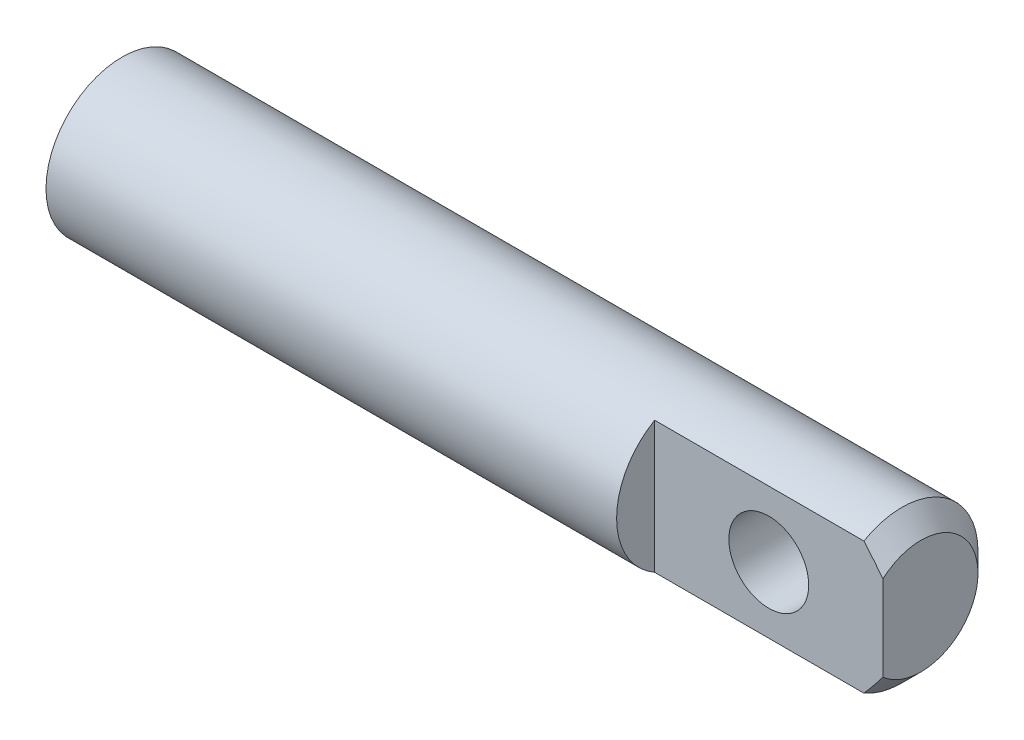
ISO-10303-21;
HEADER;
FILE_DESCRIPTION(('STEP AP214'),'2;1');
FILE_NAME('part.step','',(''),(''),'','','');
FILE_SCHEMA(('AUTOMOTIVE_DESIGN { 1 0 10303 214 1 1 1 1 }'));
ENDSEC;
DATA;
#1=APPLICATION_CONTEXT('core data for automotive mechanical design processes');
#2=APPLICATION_PROTOCOL_DEFINITION('international standard','automotive_design',2000,#1);
#3=PRODUCT_CONTEXT('',#1,'mechanical');
#4=PRODUCT('Part','Part','',(#3));
#5=PRODUCT_RELATED_PRODUCT_CATEGORY('part','',(#4));
#6=PRODUCT_DEFINITION_FORMATION('','',#4);
#7=PRODUCT_DEFINITION_CONTEXT('part definition',#1,'design');
#8=PRODUCT_DEFINITION('design','',#6,#7);
#9=PRODUCT_DEFINITION_SHAPE('','',#8);
#10=(LENGTH_UNIT() NAMED_UNIT(*) SI_UNIT(.MILLI.,.METRE.));
#11=(NAMED_UNIT(*) PLANE_ANGLE_UNIT() SI_UNIT($,.RADIAN.));
#12=(NAMED_UNIT(*) SI_UNIT($,.STERADIAN.) SOLID_ANGLE_UNIT());
#13=UNCERTAINTY_MEASURE_WITH_UNIT(LENGTH_MEASURE(1.E-05),#10,'distance_accuracy_value','');
#14=(GEOMETRIC_REPRESENTATION_CONTEXT(3) GLOBAL_UNCERTAINTY_ASSIGNED_CONTEXT((#13)) GLOBAL_UNIT_ASSIGNED_CONTEXT((#10,
#11,#12)) REPRESENTATION_CONTEXT('',''));
#15=CARTESIAN_POINT('',(0.,0.,0.));
#16=DIRECTION('',(0.,0.,1.));
#17=DIRECTION('',(1.,0.,0.));
#18=AXIS2_PLACEMENT_3D('',#15,#16,#17);
#19=CARTESIAN_POINT('',(0.,0.,0.));
#20=DIRECTION('',(1.,0.,0.));
#21=DIRECTION('',(0.,0.,-1.));
#22=AXIS2_PLACEMENT_3D('',#19,#20,#21);
#23=PLANE('',#22);
#24=CARTESIAN_POINT('',(0.,0.,0.));
#25=DIRECTION('',(-1.,0.,0.));
#26=DIRECTION('',(0.,0.,1.));
#27=AXIS2_PLACEMENT_3D('',#24,#25,#26);
#28=CIRCLE('',#27,2.);
#29=CARTESIAN_POINT('',(0.,0.,2.));
#30=VERTEX_POINT('',#29);
#31=EDGE_CURVE('E39',#30,#30,#28,.T.);
#32=ORIENTED_EDGE('',*,*,#31,.T.);
#33=EDGE_LOOP('',(#32));
#34=FACE_BOUND('',#33,.T.);
#35=ADVANCED_FACE('F32',(#34),#23,.F.);
#36=CARTESIAN_POINT('',(0.,0.,0.));
#37=DIRECTION('',(-1.,0.,0.));
#38=DIRECTION('',(0.,0.,1.));
#39=AXIS2_PLACEMENT_3D('',#36,#37,#38);
#40=CYLINDRICAL_SURFACE('',#39,2.);
#41=CARTESIAN_POINT('',(19.05,0.,-2.));
#42=CARTESIAN_POINT('',(19.0499964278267,0.054864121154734,-1.99999683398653));
#43=CARTESIAN_POINT('',(19.0456747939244,0.109783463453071,-1.99771881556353));
#44=CARTESIAN_POINT('',(19.0285895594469,0.217977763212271,-1.98883014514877));
#45=CARTESIAN_POINT('',(19.0158121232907,0.271249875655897,-1.98221239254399));
#46=CARTESIAN_POINT('',(18.9824634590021,0.374423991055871,-1.96533181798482));
#47=CARTESIAN_POINT('',(18.9619234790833,0.424338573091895,-1.95508362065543));
#48=CARTESIAN_POINT('',(18.9138063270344,0.519927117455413,-1.93186406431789));
#49=CARTESIAN_POINT('',(18.886229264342,0.565601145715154,-1.9188927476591));
#50=CARTESIAN_POINT('',(18.8228024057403,0.65473592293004,-1.89040981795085));
#51=CARTESIAN_POINT('',(18.7865327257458,0.697862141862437,-1.87478813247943));
#52=CARTESIAN_POINT('',(18.7076628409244,0.777732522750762,-1.84309034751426));
#53=CARTESIAN_POINT('',(18.6650573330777,0.814471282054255,-1.8270138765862));
#54=CARTESIAN_POINT('',(18.5702620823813,0.883766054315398,-1.79458801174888));
#55=CARTESIAN_POINT('',(18.5175595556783,0.915672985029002,-1.77833825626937));
#56=CARTESIAN_POINT('',(18.4066105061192,0.970039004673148,-1.74927996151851));
#57=CARTESIAN_POINT('',(18.3483682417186,0.992505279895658,-1.73646880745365));
#58=CARTESIAN_POINT('',(18.2316345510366,1.02581389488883,-1.71699156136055));
#59=CARTESIAN_POINT('',(18.17338254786,1.03729066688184,-1.70999366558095));
#60=CARTESIAN_POINT('',(18.0553959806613,1.05021032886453,-1.70209360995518));
#61=CARTESIAN_POINT('',(17.9956632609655,1.05166512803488,-1.70118421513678));
#62=CARTESIAN_POINT('',(17.8851179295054,1.04496287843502,-1.70530281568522));
#63=CARTESIAN_POINT('',(17.8341911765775,1.03807876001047,-1.70954469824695));
#64=CARTESIAN_POINT('',(17.7343599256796,1.01712241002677,-1.72209458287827));
#65=CARTESIAN_POINT('',(17.6854562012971,1.00304745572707,-1.73040412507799));
#66=CARTESIAN_POINT('',(17.5896697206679,0.967881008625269,-1.75032008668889));
#67=CARTESIAN_POINT('',(17.5428584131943,0.946636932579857,-1.76199731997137));
#68=CARTESIAN_POINT('',(17.4532306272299,0.897858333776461,-1.78734588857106));
#69=CARTESIAN_POINT('',(17.4104159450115,0.870321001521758,-1.80101811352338));
#70=CARTESIAN_POINT('',(17.3236097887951,0.805196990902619,-1.8311522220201));
#71=CARTESIAN_POINT('',(17.2803113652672,0.766739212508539,-1.84773486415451));
#72=CARTESIAN_POINT('',(17.2004725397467,0.683082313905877,-1.88026963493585));
#73=CARTESIAN_POINT('',(17.1639360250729,0.637879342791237,-1.89622139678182));
#74=CARTESIAN_POINT('',(17.0967089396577,0.538834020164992,-1.9267817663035));
#75=CARTESIAN_POINT('',(17.0664607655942,0.48464945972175,-1.94126499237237));
#76=CARTESIAN_POINT('',(17.0157686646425,0.371011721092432,-1.96614386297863));
#77=CARTESIAN_POINT('',(16.9953162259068,0.311563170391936,-1.97654305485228));
#78=CARTESIAN_POINT('',(16.9666136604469,0.194698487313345,-1.9912936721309));
#79=CARTESIAN_POINT('',(16.9574465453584,0.13756541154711,-1.99609753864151));
#80=CARTESIAN_POINT('',(16.9486534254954,0.0223804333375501,-2.00070334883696));
#81=CARTESIAN_POINT('',(16.949022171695,-0.0356709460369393,-2.00050804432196));
#82=CARTESIAN_POINT('',(16.9588136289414,-0.145639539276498,-1.9953836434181));
#83=CARTESIAN_POINT('',(16.9674431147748,-0.197649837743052,-1.99086929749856));
#84=CARTESIAN_POINT('',(16.9922193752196,-0.29936409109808,-1.97813273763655));
#85=CARTESIAN_POINT('',(17.0083669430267,-0.34906780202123,-1.96991013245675));
#86=CARTESIAN_POINT('',(17.0480721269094,-0.446276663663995,-1.95022110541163));
#87=CARTESIAN_POINT('',(17.0718115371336,-0.493691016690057,-1.93867588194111));
#88=CARTESIAN_POINT('',(17.1258095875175,-0.58400578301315,-1.91341051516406));
#89=CARTESIAN_POINT('',(17.1560708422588,-0.62690437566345,-1.89968950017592));
#90=CARTESIAN_POINT('',(17.2259172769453,-0.711777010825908,-1.86965424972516));
#91=CARTESIAN_POINT('',(17.2661490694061,-0.753176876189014,-1.85321912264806));
#92=CARTESIAN_POINT('',(17.3529256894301,-0.828924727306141,-1.82060103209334));
#93=CARTESIAN_POINT('',(17.3994759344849,-0.863266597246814,-1.80441829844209));
#94=CARTESIAN_POINT('',(17.5011677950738,-0.925987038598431,-1.77309145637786));
#95=CARTESIAN_POINT('',(17.5566641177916,-0.953860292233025,-1.75807501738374));
#96=CARTESIAN_POINT('',(17.6725806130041,-0.99958188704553,-1.73249279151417));
#97=CARTESIAN_POINT('',(17.7329937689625,-1.01744423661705,-1.72192079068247));
#98=CARTESIAN_POINT('',(17.8507452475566,-1.04089614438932,-1.70783667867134));
#99=CARTESIAN_POINT('',(17.9078055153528,-1.04751606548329,-1.70373469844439));
#100=CARTESIAN_POINT('',(18.0223465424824,-1.05132201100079,-1.70139066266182));
#101=CARTESIAN_POINT('',(18.0798270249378,-1.0485137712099,-1.70314504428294));
#102=CARTESIAN_POINT('',(18.1865848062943,-1.03452866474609,-1.71166640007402));
#103=CARTESIAN_POINT('',(18.2360471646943,-1.02434795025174,-1.71783575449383));
#104=CARTESIAN_POINT('',(18.3324804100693,-0.9972297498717,-1.7337180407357));
#105=CARTESIAN_POINT('',(18.3794504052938,-0.980289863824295,-1.74343223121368));
#106=CARTESIAN_POINT('',(18.4729982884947,-0.938913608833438,-1.76607769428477));
#107=CARTESIAN_POINT('',(18.5193487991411,-0.914058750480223,-1.77917806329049));
#108=CARTESIAN_POINT('',(18.6075312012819,-0.857985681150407,-1.80688642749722));
#109=CARTESIAN_POINT('',(18.6493606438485,-0.826764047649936,-1.8214952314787));
#110=CARTESIAN_POINT('',(18.7333616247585,-0.753783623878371,-1.85299725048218));
#111=CARTESIAN_POINT('',(18.7747759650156,-0.711163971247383,-1.86992628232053));
#112=CARTESIAN_POINT('',(18.850079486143,-0.619191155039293,-1.90236151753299));
#113=CARTESIAN_POINT('',(18.8839640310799,-0.569833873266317,-1.91786684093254));
#114=CARTESIAN_POINT('',(18.9437138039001,-0.464378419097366,-1.94612151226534));
#115=CARTESIAN_POINT('',(18.969410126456,-0.408167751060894,-1.95881135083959));
#116=CARTESIAN_POINT('',(19.0106371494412,-0.291412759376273,-1.97953693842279));
#117=CARTESIAN_POINT('',(19.0261954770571,-0.230880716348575,-1.98758532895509));
#118=CARTESIAN_POINT('',(19.0408249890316,-0.141380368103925,-1.99519548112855));
#119=CARTESIAN_POINT('',(19.0442595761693,-0.113250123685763,-1.9969913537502));
#120=CARTESIAN_POINT('',(19.0488480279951,-0.0567515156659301,-1.99939444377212));
#121=CARTESIAN_POINT('',(19.0500018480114,-0.0283831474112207,-2.00000163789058));
#122=CARTESIAN_POINT('',(19.05,0.,-2.));
#123=B_SPLINE_CURVE_WITH_KNOTS('',3,(#41,#42,#43,#44,#45,#46,#47,#48,#49,#50,#51,#52,#53,#54,
#55,#56,#57,#58,#59,#60,#61,#62,#63,#64,#65,#66,#67,#68,#69,#70,#71,#72,#73,#74,#75,#76,#77,#78,
#79,#80,#81,#82,#83,#84,#85,#86,#87,#88,#89,#90,#91,#92,#93,#94,#95,#96,#97,#98,#99,#100,#101,
#102,#103,#104,#105,#106,#107,#108,#109,#110,#111,#112,#113,#114,#115,#116,#117,#118,#119,#120,
#121,#122),.UNSPECIFIED.,.T.,.F.,(4,2,2,2,2,2,2,2,2,2,2,2,2,2,2,2,2,2,2,2,2,2,2,2,2,2,2,2,2,2,2,
2,2,2,2,2,2,2,2,2,4),(0.,0.164477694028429,0.329225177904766,0.493316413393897,
0.657405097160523,0.832113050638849,1.00696806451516,1.19715271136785,1.38719232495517,
1.56544714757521,1.7434901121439,1.89746165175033,2.05149153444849,2.20903143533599,
2.36664180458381,2.54658744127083,2.72663620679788,2.91677576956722,3.10674981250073,
3.27997148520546,3.453097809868,3.61111013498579,3.76913913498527,3.93127805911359,
4.0934821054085,4.27278509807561,4.45224280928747,4.64288973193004,4.83326920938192,
5.0050093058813,5.17664494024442,5.32860681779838,5.48062270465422,5.64259984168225,
5.8046642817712,5.98920626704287,6.17386155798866,6.36211058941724,6.54984445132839,
6.63493290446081,6.72002302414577),.UNSPECIFIED.);
#124=CARTESIAN_POINT('',(19.05,0.,-2.));
#125=VERTEX_POINT('',#124);
#126=EDGE_CURVE('E70',#125,#125,#123,.T.);
#127=ORIENTED_EDGE('',*,*,#126,.T.);
#128=EDGE_LOOP('',(#127));
#129=FACE_BOUND('',#128,.T.);
#130=CARTESIAN_POINT('',(20.5,0.,0.));
#131=DIRECTION('',(-1.,0.,0.));
#132=DIRECTION('',(0.,0.,1.));
#133=AXIS2_PLACEMENT_3D('',#130,#131,#132);
#134=CIRCLE('',#133,2.);
#135=CARTESIAN_POINT('',(20.5,1.73205080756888,1.));
#136=VERTEX_POINT('',#135);
#137=CARTESIAN_POINT('',(20.5,-1.73205080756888,1.));
#138=VERTEX_POINT('',#137);
#139=EDGE_CURVE('E80',#136,#138,#134,.T.);
#140=ORIENTED_EDGE('',*,*,#139,.T.);
#141=DIRECTION('',(1.,0.,0.));
#142=VECTOR('',#141,1.);
#143=CARTESIAN_POINT('',(15.,-1.73205080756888,1.));
#144=LINE('',#143,#142);
#145=CARTESIAN_POINT('',(15.,-1.73205080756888,1.));
#146=VERTEX_POINT('',#145);
#147=EDGE_CURVE('E73',#146,#138,#144,.T.);
#148=ORIENTED_EDGE('',*,*,#147,.F.);
#149=CARTESIAN_POINT('',(15.,0.,0.));
#150=DIRECTION('',(1.,0.,0.));
#151=DIRECTION('',(0.,0.,-1.));
#152=AXIS2_PLACEMENT_3D('',#149,#150,#151);
#153=CIRCLE('',#152,2.);
#154=CARTESIAN_POINT('',(15.,1.73205080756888,1.));
#155=VERTEX_POINT('',#154);
#156=EDGE_CURVE('E64',#155,#146,#153,.T.);
#157=ORIENTED_EDGE('',*,*,#156,.F.);
#158=DIRECTION('',(1.,0.,0.));
#159=VECTOR('',#158,1.);
#160=CARTESIAN_POINT('',(15.,1.73205080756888,1.));
#161=LINE('',#160,#159);
#162=EDGE_CURVE('E74',#155,#136,#161,.T.);
#163=ORIENTED_EDGE('',*,*,#162,.T.);
#164=EDGE_LOOP('',(#140,#148,#157,#163));
#165=FACE_BOUND('',#164,.T.);
#166=ORIENTED_EDGE('',*,*,#31,.F.);
#167=EDGE_LOOP('',(#166));
#168=FACE_BOUND('',#167,.T.);
#169=ADVANCED_FACE('F77',(#129,#165,#168),#40,.T.);
#170=CARTESIAN_POINT('',(21.,0.,0.));
#171=DIRECTION('',(-1.,0.,0.));
#172=DIRECTION('',(0.,0.,1.));
#173=AXIS2_PLACEMENT_3D('',#170,#171,#172);
#174=CONICAL_SURFACE('',#173,1.5,0.785398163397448);
#175=ORIENTED_EDGE('',*,*,#139,.F.);
#176=CARTESIAN_POINT('',(18.5394260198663,3.83225080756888,1.));
#177=CARTESIAN_POINT('',(18.6241259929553,3.7447112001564,1.));
#178=CARTESIAN_POINT('',(18.7087341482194,3.65708252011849,1.));
#179=CARTESIAN_POINT('',(18.877715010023,3.4815963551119,1.));
#180=CARTESIAN_POINT('',(18.962087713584,3.39373886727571,1.));
#181=CARTESIAN_POINT('',(19.214860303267,3.12965797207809,1.));
#182=CARTESIAN_POINT('',(19.3828254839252,2.95301808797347,1.));
#183=CARTESIAN_POINT('',(19.7135109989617,2.60155131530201,1.));
#184=CARTESIAN_POINT('',(19.8762687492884,2.42675985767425,1.));
#185=CARTESIAN_POINT('',(20.1179042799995,2.16232006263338,1.));
#186=CARTESIAN_POINT('',(20.1980237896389,2.07380805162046,1.));
#187=CARTESIAN_POINT('',(20.3570727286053,1.89572176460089,1.));
#188=CARTESIAN_POINT('',(20.4360021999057,1.80614752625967,1.));
#189=CARTESIAN_POINT('',(20.5611684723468,1.66126899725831,1.));
#190=CARTESIAN_POINT('',(20.6079663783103,1.60645005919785,1.));
#191=CARTESIAN_POINT('',(20.7007217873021,1.49609455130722,1.));
#192=CARTESIAN_POINT('',(20.746679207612,1.44055791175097,1.));
#193=CARTESIAN_POINT('',(20.8379484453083,1.32797390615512,1.));
#194=CARTESIAN_POINT('',(20.8832482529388,1.27091676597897,1.));
#195=CARTESIAN_POINT('',(20.9722545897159,1.15557501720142,1.));
#196=CARTESIAN_POINT('',(21.0159612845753,1.09729053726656,1.));
#197=CARTESIAN_POINT('',(21.1017589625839,0.978170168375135,1.));
#198=CARTESIAN_POINT('',(21.1438149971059,0.917308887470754,1.));
#199=CARTESIAN_POINT('',(21.2244909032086,0.793192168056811,1.));
#200=CARTESIAN_POINT('',(21.2631060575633,0.72993360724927,1.));
#201=CARTESIAN_POINT('',(21.3344399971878,0.60115056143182,1.));
#202=CARTESIAN_POINT('',(21.3672265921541,0.535664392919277,1.));
#203=CARTESIAN_POINT('',(21.4242601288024,0.401101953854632,1.));
#204=CARTESIAN_POINT('',(21.4485358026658,0.332038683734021,1.));
#205=CARTESIAN_POINT('',(21.4747332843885,0.228445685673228,1.));
#206=CARTESIAN_POINT('',(21.4816684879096,0.195182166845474,1.));
#207=CARTESIAN_POINT('',(21.492365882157,0.128139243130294,1.));
#208=CARTESIAN_POINT('',(21.4961283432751,0.0943598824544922,1.));
#209=CARTESIAN_POINT('',(21.5002117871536,0.0266892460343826,1.));
#210=CARTESIAN_POINT('',(21.5005429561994,-0.00720139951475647,1.));
#211=CARTESIAN_POINT('',(21.4977752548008,-0.074835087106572,1.));
#212=CARTESIAN_POINT('',(21.494676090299,-0.108578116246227,1.));
#213=CARTESIAN_POINT('',(21.4805994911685,-0.208512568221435,1.));
#214=CARTESIAN_POINT('',(21.4648761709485,-0.274066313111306,1.));
#215=CARTESIAN_POINT('',(21.4341501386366,-0.370108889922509,1.));
#216=CARTESIAN_POINT('',(21.4226684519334,-0.401841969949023,1.));
#217=CARTESIAN_POINT('',(21.3977444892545,-0.464529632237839,1.));
#218=CARTESIAN_POINT('',(21.3843026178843,-0.495484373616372,1.));
#219=CARTESIAN_POINT('',(21.3412275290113,-0.588029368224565,1.));
#220=CARTESIAN_POINT('',(21.3091323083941,-0.648465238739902,1.));
#221=CARTESIAN_POINT('',(21.2407049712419,-0.766913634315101,1.));
#222=CARTESIAN_POINT('',(21.2043676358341,-0.824923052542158,1.));
#223=CARTESIAN_POINT('',(21.1287190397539,-0.93928404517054,1.));
#224=CARTESIAN_POINT('',(21.0893965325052,-0.995628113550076,1.));
#225=CARTESIAN_POINT('',(21.0088070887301,-1.10685190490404,1.));
#226=CARTESIAN_POINT('',(20.9675411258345,-1.16173233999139,1.));
#227=CARTESIAN_POINT('',(20.883049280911,-1.27112215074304,1.));
#228=CARTESIAN_POINT('',(20.8398046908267,-1.32561700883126,1.));
#229=CARTESIAN_POINT('',(20.7522506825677,-1.43374642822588,1.));
#230=CARTESIAN_POINT('',(20.7079411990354,-1.48738093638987,1.));
#231=CARTESIAN_POINT('',(20.5740410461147,-1.64702819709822,1.));
#232=CARTESIAN_POINT('',(20.4832698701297,-1.75204921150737,1.));
#233=CARTESIAN_POINT('',(20.3154377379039,-1.9426687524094,1.));
#234=CARTESIAN_POINT('',(20.2386729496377,-2.02853055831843,1.));
#235=CARTESIAN_POINT('',(20.0842043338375,-2.19940947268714,1.));
#236=CARTESIAN_POINT('',(20.0065004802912,-2.28442655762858,1.));
#237=CARTESIAN_POINT('',(19.7722404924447,-2.53871324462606,1.));
#238=CARTESIAN_POINT('',(19.61468051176,-2.70705628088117,1.));
#239=CARTESIAN_POINT('',(19.304543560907,-3.03540360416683,1.));
#240=CARTESIAN_POINT('',(19.1520280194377,-3.19546619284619,1.));
#241=CARTESIAN_POINT('',(18.922652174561,-3.43481167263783,1.));
#242=CARTESIAN_POINT('',(18.8461359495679,-3.51442460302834,1.));
#243=CARTESIAN_POINT('',(18.692913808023,-3.67346650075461,1.));
#244=CARTESIAN_POINT('',(18.6162078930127,-3.75289546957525,1.));
#245=CARTESIAN_POINT('',(18.5394260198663,-3.83225080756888,1.));
#246=B_SPLINE_CURVE_WITH_KNOTS('',3,(#176,#177,#178,#179,#180,#181,#182,#183,#184,#185,#186,
#187,#188,#189,#190,#191,#192,#193,#194,#195,#196,#197,#198,#199,#200,#201,#202,#203,#204,#205,
#206,#207,#208,#209,#210,#211,#212,#213,#214,#215,#216,#217,#218,#219,#220,#221,#222,#223,#224,
#225,#226,#227,#228,#229,#230,#231,#232,#233,#234,#235,#236,#237,#238,#239,#240,#241,#242,#243,
#244,#245),.UNSPECIFIED.,.F.,.F.,(4,2,2,2,2,2,2,2,2,2,2,2,2,2,2,2,2,2,2,2,2,2,2,2,2,2,2,2,2,2,2,
2,2,2,4),(0.,0.365425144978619,0.730854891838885,1.46209867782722,2.17857445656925,
2.53673226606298,2.89487741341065,3.11110360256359,3.32735095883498,3.5458908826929,
3.76440800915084,3.98626822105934,4.20842805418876,4.42780463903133,4.6464333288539,
4.74824013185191,4.85003825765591,4.95153409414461,5.05303863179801,5.25410882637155,
5.35530965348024,5.45648962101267,5.66148363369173,5.86673255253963,6.07279728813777,
6.27875986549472,6.4874476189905,6.69614821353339,7.11253886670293,7.45805536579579,
7.80358145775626,8.49528494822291,9.15855260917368,9.4898173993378,9.82107950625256),.UNSPECIFIED.);
#247=CARTESIAN_POINT('',(21.,1.1180339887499,1.));
#248=VERTEX_POINT('',#247);
#249=EDGE_CURVE('E51',#136,#248,#246,.T.);
#250=ORIENTED_EDGE('',*,*,#249,.T.);
#251=CARTESIAN_POINT('',(21.,0.,0.));
#252=DIRECTION('',(-1.,0.,0.));
#253=DIRECTION('',(0.,0.,1.));
#254=AXIS2_PLACEMENT_3D('',#251,#252,#253);
#255=CIRCLE('',#254,1.5);
#256=CARTESIAN_POINT('',(21.,-1.11803398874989,1.));
#257=VERTEX_POINT('',#256);
#258=EDGE_CURVE('E90',#248,#257,#255,.T.);
#259=ORIENTED_EDGE('',*,*,#258,.T.);
#260=EDGE_CURVE('E46',#257,#138,#246,.T.);
#261=ORIENTED_EDGE('',*,*,#260,.T.);
#262=EDGE_LOOP('',(#175,#250,#259,#261));
#263=FACE_BOUND('',#262,.T.);
#264=ADVANCED_FACE('F92',(#263),#174,.T.);
#265=CARTESIAN_POINT('',(21.,1.5,0.));
#266=DIRECTION('',(-1.,0.,0.));
#267=DIRECTION('',(0.,0.,1.));
#268=AXIS2_PLACEMENT_3D('',#265,#266,#267);
#269=PLANE('',#268);
#270=ORIENTED_EDGE('',*,*,#258,.F.);
#271=DIRECTION('',(0.,-1.,0.));
#272=VECTOR('',#271,1.);
#273=CARTESIAN_POINT('',(21.,1.5,1.));
#274=LINE('',#273,#272);
#275=EDGE_CURVE('E11',#248,#257,#274,.T.);
#276=ORIENTED_EDGE('',*,*,#275,.T.);
#277=EDGE_LOOP('',(#270,#276));
#278=FACE_BOUND('',#277,.T.);
#279=ADVANCED_FACE('F98',(#278),#269,.F.);
#280=CARTESIAN_POINT('',(15.,1.73205080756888,1.));
#281=DIRECTION('',(0.,0.,-1.));
#282=DIRECTION('',(-1.,0.,0.));
#283=AXIS2_PLACEMENT_3D('',#280,#281,#282);
#284=PLANE('',#283);
#285=CARTESIAN_POINT('',(18.,0.,1.));
#286=DIRECTION('',(0.,0.,1.));
#287=DIRECTION('',(1.,0.,0.));
#288=AXIS2_PLACEMENT_3D('',#285,#286,#287);
#289=CIRCLE('',#288,1.05);
#290=CARTESIAN_POINT('',(19.05,0.,1.));
#291=VERTEX_POINT('',#290);
#292=EDGE_CURVE('E125',#291,#291,#289,.T.);
#293=ORIENTED_EDGE('',*,*,#292,.F.);
#294=EDGE_LOOP('',(#293));
#295=FACE_BOUND('',#294,.T.);
#296=ORIENTED_EDGE('',*,*,#162,.F.);
#297=DIRECTION('',(0.,1.,0.));
#298=VECTOR('',#297,1.);
#299=CARTESIAN_POINT('',(15.,1.73205080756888,1.));
#300=LINE('',#299,#298);
#301=EDGE_CURVE('E67',#146,#155,#300,.T.);
#302=ORIENTED_EDGE('',*,*,#301,.F.);
#303=ORIENTED_EDGE('',*,*,#147,.T.);
#304=ORIENTED_EDGE('',*,*,#260,.F.);
#305=ORIENTED_EDGE('',*,*,#275,.F.);
#306=ORIENTED_EDGE('',*,*,#249,.F.);
#307=EDGE_LOOP('',(#296,#302,#303,#304,#305,#306));
#308=FACE_BOUND('',#307,.T.);
#309=ADVANCED_FACE('F72',(#295,#308),#284,.F.);
#310=CARTESIAN_POINT('',(15.,0.,0.));
#311=DIRECTION('',(1.,0.,0.));
#312=DIRECTION('',(0.,0.,-1.));
#313=AXIS2_PLACEMENT_3D('',#310,#311,#312);
#314=PLANE('',#313);
#315=ORIENTED_EDGE('',*,*,#156,.T.);
#316=ORIENTED_EDGE('',*,*,#301,.T.);
#317=EDGE_LOOP('',(#315,#316));
#318=FACE_BOUND('',#317,.T.);
#319=ADVANCED_FACE('F66',(#318),#314,.T.);
#320=CARTESIAN_POINT('',(18.,0.,-2.));
#321=DIRECTION('',(0.,0.,1.));
#322=DIRECTION('',(1.,0.,0.));
#323=AXIS2_PLACEMENT_3D('',#320,#321,#322);
#324=CYLINDRICAL_SURFACE('',#323,1.05);
#325=ORIENTED_EDGE('',*,*,#292,.T.);
#326=EDGE_LOOP('',(#325));
#327=FACE_BOUND('',#326,.T.);
#328=ORIENTED_EDGE('',*,*,#126,.F.);
#329=EDGE_LOOP('',(#328));
#330=FACE_BOUND('',#329,.T.);
#331=ADVANCED_FACE('F126',(#327,#330),#324,.F.);
#332=CLOSED_SHELL('',(#35,#169,#264,#279,#309,#319,#331));
#333=MANIFOLD_SOLID_BREP('B2',#332);
#334=ADVANCED_BREP_SHAPE_REPRESENTATION('',(#18,#333),#14);
#335=SHAPE_DEFINITION_REPRESENTATION(#9,#334);
ENDSEC;
END-ISO-10303-21;
